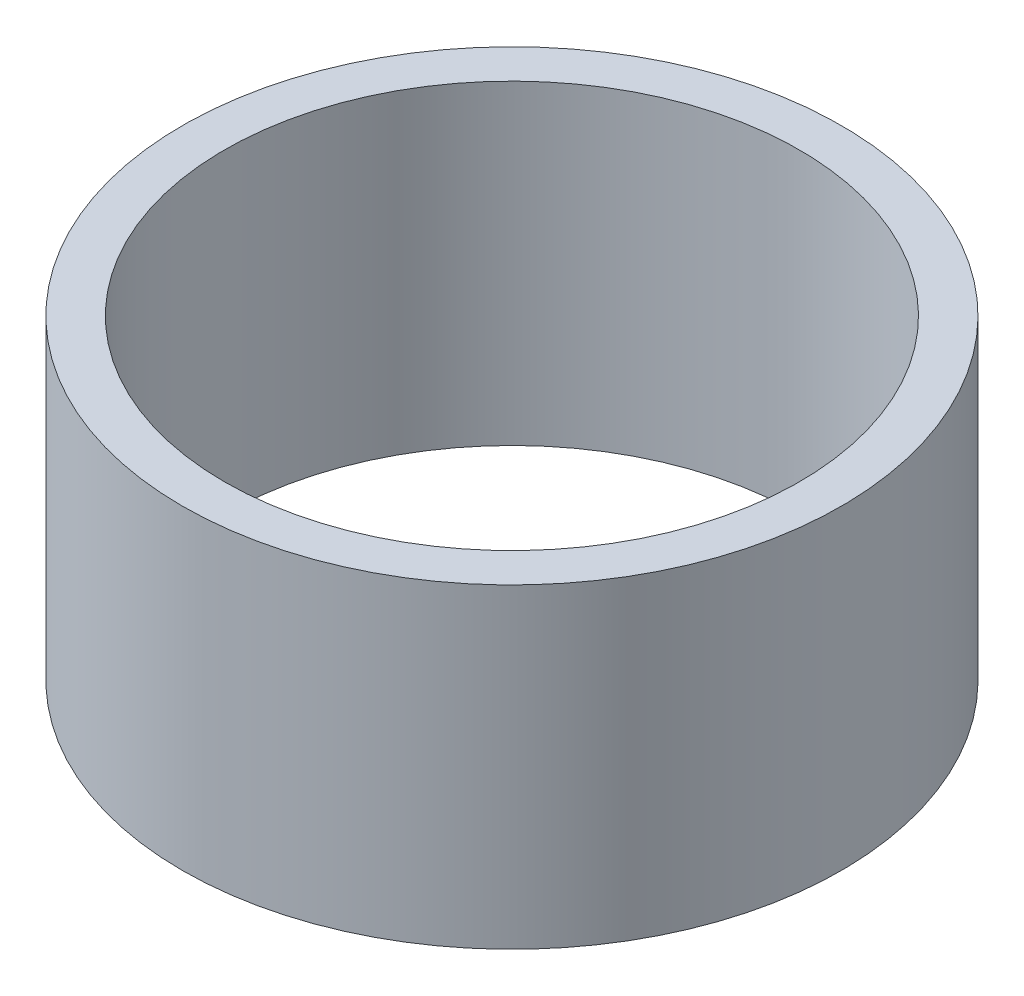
ISO-10303-21;
HEADER;
FILE_DESCRIPTION(('STEP AP214'),'2;1');
FILE_NAME('part.step','',(''),(''),'','','');
FILE_SCHEMA(('AUTOMOTIVE_DESIGN { 1 0 10303 214 1 1 1 1 }'));
ENDSEC;
DATA;
#1=APPLICATION_CONTEXT('core data for automotive mechanical design processes');
#2=APPLICATION_PROTOCOL_DEFINITION('international standard','automotive_design',2000,#1);
#3=PRODUCT_CONTEXT('',#1,'mechanical');
#4=PRODUCT('Part','Part','',(#3));
#5=PRODUCT_RELATED_PRODUCT_CATEGORY('part','',(#4));
#6=PRODUCT_DEFINITION_FORMATION('','',#4);
#7=PRODUCT_DEFINITION_CONTEXT('part definition',#1,'design');
#8=PRODUCT_DEFINITION('design','',#6,#7);
#9=PRODUCT_DEFINITION_SHAPE('','',#8);
#10=(LENGTH_UNIT() NAMED_UNIT(*) SI_UNIT(.MILLI.,.METRE.));
#11=(NAMED_UNIT(*) PLANE_ANGLE_UNIT() SI_UNIT($,.RADIAN.));
#12=(NAMED_UNIT(*) SI_UNIT($,.STERADIAN.) SOLID_ANGLE_UNIT());
#13=UNCERTAINTY_MEASURE_WITH_UNIT(LENGTH_MEASURE(1.E-05),#10,'distance_accuracy_value','');
#14=(GEOMETRIC_REPRESENTATION_CONTEXT(3) GLOBAL_UNCERTAINTY_ASSIGNED_CONTEXT((#13)) GLOBAL_UNIT_ASSIGNED_CONTEXT((#10,
#11,#12)) REPRESENTATION_CONTEXT('',''));
#15=CARTESIAN_POINT('',(0.,0.,0.));
#16=DIRECTION('',(0.,0.,1.));
#17=DIRECTION('',(1.,0.,0.));
#18=AXIS2_PLACEMENT_3D('',#15,#16,#17);
#19=CARTESIAN_POINT('',(0.,28.120065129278,0.));
#20=DIRECTION('',(0.,1.,0.));
#21=DIRECTION('',(0.,0.,1.));
#22=AXIS2_PLACEMENT_3D('',#19,#20,#21);
#23=CYLINDRICAL_SURFACE('',#22,20.5);
#24=CARTESIAN_POINT('',(0.,3.39427684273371,0.));
#25=DIRECTION('',(0.,1.,0.));
#26=DIRECTION('',(0.,0.,1.));
#27=AXIS2_PLACEMENT_3D('',#24,#25,#26);
#28=CIRCLE('',#27,20.5);
#29=CARTESIAN_POINT('',(0.,3.39427684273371,20.5));
#30=VERTEX_POINT('',#29);
#31=EDGE_CURVE('E10',#30,#30,#28,.T.);
#32=ORIENTED_EDGE('',*,*,#31,.F.);
#33=EDGE_LOOP('',(#32));
#34=FACE_BOUND('',#33,.T.);
#35=CARTESIAN_POINT('',(0.,25.8942768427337,0.));
#36=DIRECTION('',(0.,1.,0.));
#37=DIRECTION('',(0.,0.,1.));
#38=AXIS2_PLACEMENT_3D('',#35,#36,#37);
#39=CIRCLE('',#38,20.5);
#40=CARTESIAN_POINT('',(0.,25.8942768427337,20.5));
#41=VERTEX_POINT('',#40);
#42=EDGE_CURVE('E45',#41,#41,#39,.T.);
#43=ORIENTED_EDGE('',*,*,#42,.T.);
#44=EDGE_LOOP('',(#43));
#45=FACE_BOUND('',#44,.T.);
#46=ADVANCED_FACE('F31',(#34,#45),#23,.F.);
#47=CARTESIAN_POINT('',(20.5,3.39427684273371,0.));
#48=DIRECTION('',(0.,1.,0.));
#49=DIRECTION('',(0.,0.,1.));
#50=AXIS2_PLACEMENT_3D('',#47,#48,#49);
#51=PLANE('',#50);
#52=CARTESIAN_POINT('',(0.,3.39427684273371,0.));
#53=DIRECTION('',(0.,1.,0.));
#54=DIRECTION('',(0.,0.,1.));
#55=AXIS2_PLACEMENT_3D('',#52,#53,#54);
#56=CIRCLE('',#55,23.5);
#57=CARTESIAN_POINT('',(0.,3.39427684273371,23.5));
#58=VERTEX_POINT('',#57);
#59=EDGE_CURVE('E37',#58,#58,#56,.T.);
#60=ORIENTED_EDGE('',*,*,#59,.F.);
#61=EDGE_LOOP('',(#60));
#62=FACE_BOUND('',#61,.T.);
#63=ORIENTED_EDGE('',*,*,#31,.T.);
#64=EDGE_LOOP('',(#63));
#65=FACE_BOUND('',#64,.T.);
#66=ADVANCED_FACE('F60',(#62,#65),#51,.F.);
#67=CARTESIAN_POINT('',(0.,28.120065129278,0.));
#68=DIRECTION('',(0.,1.,0.));
#69=DIRECTION('',(0.,0.,1.));
#70=AXIS2_PLACEMENT_3D('',#67,#68,#69);
#71=CYLINDRICAL_SURFACE('',#70,23.5);
#72=CARTESIAN_POINT('',(0.,25.8942768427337,0.));
#73=DIRECTION('',(0.,1.,0.));
#74=DIRECTION('',(0.,0.,1.));
#75=AXIS2_PLACEMENT_3D('',#72,#73,#74);
#76=CIRCLE('',#75,23.5);
#77=CARTESIAN_POINT('',(0.,25.8942768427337,23.5));
#78=VERTEX_POINT('',#77);
#79=EDGE_CURVE('E41',#78,#78,#76,.T.);
#80=ORIENTED_EDGE('',*,*,#79,.F.);
#81=EDGE_LOOP('',(#80));
#82=FACE_BOUND('',#81,.T.);
#83=ORIENTED_EDGE('',*,*,#59,.T.);
#84=EDGE_LOOP('',(#83));
#85=FACE_BOUND('',#84,.T.);
#86=ADVANCED_FACE('F55',(#82,#85),#71,.T.);
#87=CARTESIAN_POINT('',(20.5,25.8942768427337,0.));
#88=DIRECTION('',(0.,-1.,0.));
#89=DIRECTION('',(0.,0.,-1.));
#90=AXIS2_PLACEMENT_3D('',#87,#88,#89);
#91=PLANE('',#90);
#92=ORIENTED_EDGE('',*,*,#42,.F.);
#93=EDGE_LOOP('',(#92));
#94=FACE_BOUND('',#93,.T.);
#95=ORIENTED_EDGE('',*,*,#79,.T.);
#96=EDGE_LOOP('',(#95));
#97=FACE_BOUND('',#96,.T.);
#98=ADVANCED_FACE('F52',(#94,#97),#91,.F.);
#99=CLOSED_SHELL('',(#46,#66,#86,#98));
#100=MANIFOLD_SOLID_BREP('B2',#99);
#101=ADVANCED_BREP_SHAPE_REPRESENTATION('',(#18,#100),#14);
#102=SHAPE_DEFINITION_REPRESENTATION(#9,#101);
ENDSEC;
END-ISO-10303-21;
